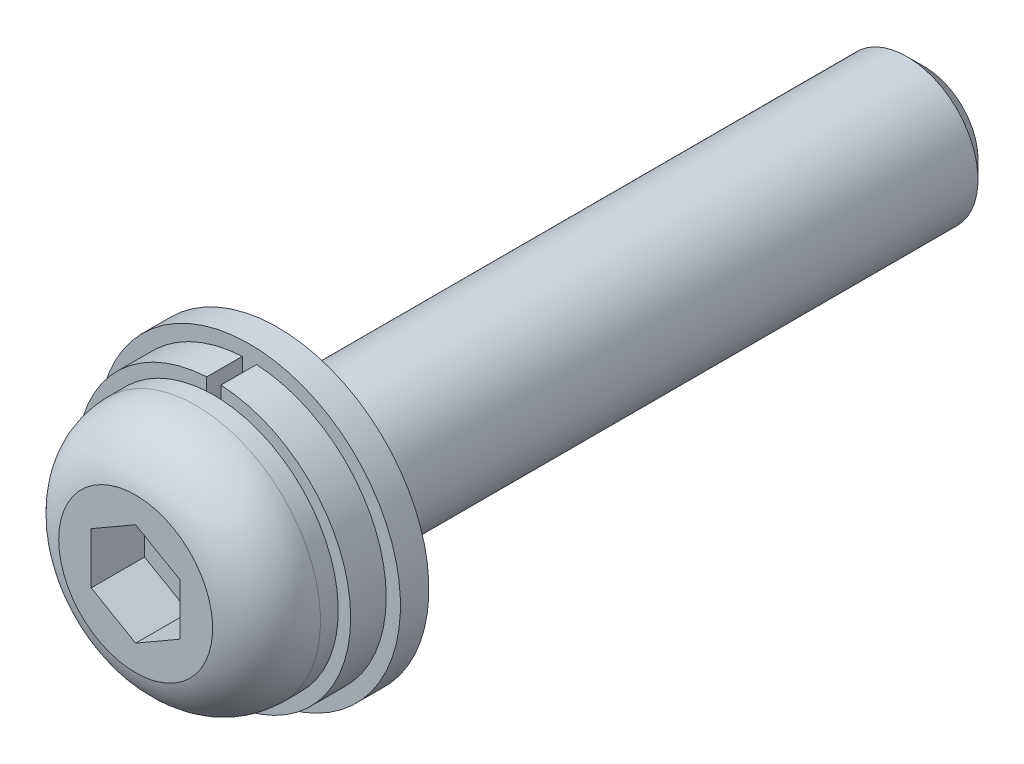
ISO-10303-21;
HEADER;
FILE_DESCRIPTION(('STEP AP214'),'2;1');
FILE_NAME('part.step','',(''),(''),'','','');
FILE_SCHEMA(('AUTOMOTIVE_DESIGN { 1 0 10303 214 1 1 1 1 }'));
ENDSEC;
DATA;
#1=APPLICATION_CONTEXT('core data for automotive mechanical design processes');
#2=APPLICATION_PROTOCOL_DEFINITION('international standard','automotive_design',2000,#1);
#3=PRODUCT_CONTEXT('',#1,'mechanical');
#4=PRODUCT('Part','Part','',(#3));
#5=PRODUCT_RELATED_PRODUCT_CATEGORY('part','',(#4));
#6=PRODUCT_DEFINITION_FORMATION('','',#4);
#7=PRODUCT_DEFINITION_CONTEXT('part definition',#1,'design');
#8=PRODUCT_DEFINITION('design','',#6,#7);
#9=PRODUCT_DEFINITION_SHAPE('','',#8);
#10=(LENGTH_UNIT() NAMED_UNIT(*) SI_UNIT(.MILLI.,.METRE.));
#11=(NAMED_UNIT(*) PLANE_ANGLE_UNIT() SI_UNIT($,.RADIAN.));
#12=(NAMED_UNIT(*) SI_UNIT($,.STERADIAN.) SOLID_ANGLE_UNIT());
#13=UNCERTAINTY_MEASURE_WITH_UNIT(LENGTH_MEASURE(1.E-05),#10,'distance_accuracy_value','');
#14=(GEOMETRIC_REPRESENTATION_CONTEXT(3) GLOBAL_UNCERTAINTY_ASSIGNED_CONTEXT((#13)) GLOBAL_UNIT_ASSIGNED_CONTEXT((#10,
#11,#12)) REPRESENTATION_CONTEXT('',''));
#15=CARTESIAN_POINT('',(0.,0.,0.));
#16=DIRECTION('',(0.,0.,1.));
#17=DIRECTION('',(1.,0.,0.));
#18=AXIS2_PLACEMENT_3D('',#15,#16,#17);
#19=CARTESIAN_POINT('',(0.,0.,1.6));
#20=DIRECTION('',(0.,0.,1.));
#21=DIRECTION('',(-1.,0.,0.));
#22=AXIS2_PLACEMENT_3D('',#19,#20,#21);
#23=PLANE('',#22);
#24=DIRECTION('',(0.,1.,0.));
#25=VECTOR('',#24,1.);
#26=CARTESIAN_POINT('',(-0.4,4.08044115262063,1.6));
#27=LINE('',#26,#25);
#28=CARTESIAN_POINT('',(-0.4,4.18090899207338,1.6));
#29=VERTEX_POINT('',#28);
#30=CARTESIAN_POINT('',(-0.4,7.68960337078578,1.6));
#31=VERTEX_POINT('',#30);
#32=EDGE_CURVE('E9',#29,#31,#27,.T.);
#33=ORIENTED_EDGE('',*,*,#32,.F.);
#34=CARTESIAN_POINT('',(0.,0.,1.6));
#35=DIRECTION('',(0.,0.,1.));
#36=DIRECTION('',(-1.,0.,0.));
#37=AXIS2_PLACEMENT_3D('',#34,#35,#36);
#38=CIRCLE('',#37,4.2);
#39=CARTESIAN_POINT('',(0.4,4.18090899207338,1.6));
#40=VERTEX_POINT('',#39);
#41=EDGE_CURVE('E199',#40,#29,#38,.T.);
#42=ORIENTED_EDGE('',*,*,#41,.F.);
#43=DIRECTION('',(0.,-1.,0.));
#44=VECTOR('',#43,1.);
#45=CARTESIAN_POINT('',(0.4,4.08044115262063,1.6));
#46=LINE('',#45,#44);
#47=CARTESIAN_POINT('',(0.4,7.68960337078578,1.6));
#48=VERTEX_POINT('',#47);
#49=EDGE_CURVE('E182',#48,#40,#46,.T.);
#50=ORIENTED_EDGE('',*,*,#49,.F.);
#51=CARTESIAN_POINT('',(0.,0.,1.6));
#52=DIRECTION('',(0.,0.,1.));
#53=DIRECTION('',(1.,0.,0.));
#54=AXIS2_PLACEMENT_3D('',#51,#52,#53);
#55=CIRCLE('',#54,7.7);
#56=EDGE_CURVE('E24',#31,#48,#55,.T.);
#57=ORIENTED_EDGE('',*,*,#56,.F.);
#58=EDGE_LOOP('',(#33,#42,#50,#57));
#59=FACE_BOUND('',#58,.T.);
#60=CARTESIAN_POINT('',(0.,0.,1.6));
#61=DIRECTION('',(0.,0.,1.));
#62=DIRECTION('',(-1.,0.,0.));
#63=AXIS2_PLACEMENT_3D('',#60,#61,#62);
#64=CIRCLE('',#63,8.5);
#65=CARTESIAN_POINT('',(-8.5,0.,1.6));
#66=VERTEX_POINT('',#65);
#67=EDGE_CURVE('E190',#66,#66,#64,.T.);
#68=ORIENTED_EDGE('',*,*,#67,.T.);
#69=EDGE_LOOP('',(#68));
#70=FACE_BOUND('',#69,.T.);
#71=ADVANCED_FACE('F14',(#59,#70),#23,.T.);
#72=CARTESIAN_POINT('',(0.,0.,0.));
#73=DIRECTION('',(0.,0.,1.));
#74=DIRECTION('',(-1.,0.,0.));
#75=AXIS2_PLACEMENT_3D('',#72,#73,#74);
#76=PLANE('',#75);
#77=CARTESIAN_POINT('',(0.,0.,0.));
#78=DIRECTION('',(0.,0.,1.));
#79=DIRECTION('',(-1.,0.,0.));
#80=AXIS2_PLACEMENT_3D('',#77,#78,#79);
#81=CIRCLE('',#80,8.5);
#82=CARTESIAN_POINT('',(-8.5,0.,0.));
#83=VERTEX_POINT('',#82);
#84=EDGE_CURVE('E194',#83,#83,#81,.T.);
#85=ORIENTED_EDGE('',*,*,#84,.F.);
#86=EDGE_LOOP('',(#85));
#87=FACE_BOUND('',#86,.T.);
#88=CARTESIAN_POINT('',(0.,0.,0.));
#89=DIRECTION('',(0.,0.,1.));
#90=DIRECTION('',(-1.,0.,0.));
#91=AXIS2_PLACEMENT_3D('',#88,#89,#90);
#92=CIRCLE('',#91,4.2);
#93=CARTESIAN_POINT('',(-4.2,0.,0.));
#94=VERTEX_POINT('',#93);
#95=EDGE_CURVE('E202',#94,#94,#92,.T.);
#96=ORIENTED_EDGE('',*,*,#95,.T.);
#97=EDGE_LOOP('',(#96));
#98=FACE_BOUND('',#97,.T.);
#99=ADVANCED_FACE('F257',(#87,#98),#76,.F.);
#100=CARTESIAN_POINT('',(0.,0.,1.6));
#101=DIRECTION('',(0.,0.,-1.));
#102=DIRECTION('',(1.,0.,0.));
#103=AXIS2_PLACEMENT_3D('',#100,#101,#102);
#104=CYLINDRICAL_SURFACE('',#103,8.5);
#105=ORIENTED_EDGE('',*,*,#67,.F.);
#106=EDGE_LOOP('',(#105));
#107=FACE_BOUND('',#106,.T.);
#108=ORIENTED_EDGE('',*,*,#84,.T.);
#109=EDGE_LOOP('',(#108));
#110=FACE_BOUND('',#109,.T.);
#111=ADVANCED_FACE('F260',(#107,#110),#104,.T.);
#112=CARTESIAN_POINT('',(0.,0.,1.6));
#113=DIRECTION('',(0.,0.,-1.));
#114=DIRECTION('',(1.,0.,0.));
#115=AXIS2_PLACEMENT_3D('',#112,#113,#114);
#116=CYLINDRICAL_SURFACE('',#115,4.2);
#117=ORIENTED_EDGE('',*,*,#41,.T.);
#118=EDGE_CURVE('E253',#29,#40,#38,.T.);
#119=ORIENTED_EDGE('',*,*,#118,.T.);
#120=EDGE_LOOP('',(#117,#119));
#121=FACE_BOUND('',#120,.T.);
#122=ORIENTED_EDGE('',*,*,#95,.F.);
#123=EDGE_LOOP('',(#122));
#124=FACE_BOUND('',#123,.T.);
#125=ADVANCED_FACE('F251',(#121,#124),#116,.F.);
#126=CARTESIAN_POINT('',(0.,-2.88675134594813,5.));
#127=DIRECTION('',(0.,0.,1.));
#128=DIRECTION('',(-1.,0.,0.));
#129=AXIS2_PLACEMENT_3D('',#126,#127,#128);
#130=PLANE('',#129);
#131=DIRECTION('',(0.866025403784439,-0.5,0.));
#132=VECTOR('',#131,1.);
#133=CARTESIAN_POINT('',(-2.5,-1.44337567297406,5.));
#134=LINE('',#133,#132);
#135=CARTESIAN_POINT('',(-2.5,-1.44337567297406,5.));
#136=VERTEX_POINT('',#135);
#137=CARTESIAN_POINT('',(0.,-2.88675134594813,5.));
#138=VERTEX_POINT('',#137);
#139=EDGE_CURVE('E139',#136,#138,#134,.T.);
#140=ORIENTED_EDGE('',*,*,#139,.T.);
#141=DIRECTION('',(0.866025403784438,0.5,0.));
#142=VECTOR('',#141,1.);
#143=CARTESIAN_POINT('',(0.,-2.88675134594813,5.));
#144=LINE('',#143,#142);
#145=CARTESIAN_POINT('',(2.5,-1.44337567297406,5.));
#146=VERTEX_POINT('',#145);
#147=EDGE_CURVE('E117',#138,#146,#144,.T.);
#148=ORIENTED_EDGE('',*,*,#147,.T.);
#149=DIRECTION('',(0.,1.,0.));
#150=VECTOR('',#149,1.);
#151=CARTESIAN_POINT('',(2.5,-1.44337567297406,5.));
#152=LINE('',#151,#150);
#153=CARTESIAN_POINT('',(2.5,1.44337567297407,5.));
#154=VERTEX_POINT('',#153);
#155=EDGE_CURVE('E142',#146,#154,#152,.T.);
#156=ORIENTED_EDGE('',*,*,#155,.T.);
#157=DIRECTION('',(-0.866025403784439,0.5,0.));
#158=VECTOR('',#157,1.);
#159=CARTESIAN_POINT('',(2.5,1.44337567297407,5.));
#160=LINE('',#159,#158);
#161=CARTESIAN_POINT('',(0.,2.88675134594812,5.));
#162=VERTEX_POINT('',#161);
#163=EDGE_CURVE('E145',#154,#162,#160,.T.);
#164=ORIENTED_EDGE('',*,*,#163,.T.);
#165=DIRECTION('',(-0.866025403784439,-0.5,0.));
#166=VECTOR('',#165,1.);
#167=CARTESIAN_POINT('',(0.,2.88675134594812,5.));
#168=LINE('',#167,#166);
#169=CARTESIAN_POINT('',(-2.5,1.44337567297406,5.));
#170=VERTEX_POINT('',#169);
#171=EDGE_CURVE('E148',#162,#170,#168,.T.);
#172=ORIENTED_EDGE('',*,*,#171,.T.);
#173=DIRECTION('',(0.,-1.,0.));
#174=VECTOR('',#173,1.);
#175=CARTESIAN_POINT('',(-2.5,1.44337567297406,5.));
#176=LINE('',#175,#174);
#177=EDGE_CURVE('E120',#170,#136,#176,.T.);
#178=ORIENTED_EDGE('',*,*,#177,.T.);
#179=EDGE_LOOP('',(#140,#148,#156,#164,#172,#178));
#180=FACE_BOUND('',#179,.T.);
#181=ADVANCED_FACE('F259',(#180),#130,.T.);
#182=CARTESIAN_POINT('',(2.5,-1.44337567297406,5.));
#183=DIRECTION('',(1.,0.,0.));
#184=DIRECTION('',(0.,1.,0.));
#185=AXIS2_PLACEMENT_3D('',#182,#183,#184);
#186=PLANE('',#185);
#187=DIRECTION('',(0.,1.,0.));
#188=VECTOR('',#187,1.);
#189=CARTESIAN_POINT('',(2.5,-1.44337567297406,8.));
#190=LINE('',#189,#188);
#191=CARTESIAN_POINT('',(2.5,-1.44337567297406,8.));
#192=VERTEX_POINT('',#191);
#193=CARTESIAN_POINT('',(2.5,1.44337567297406,8.));
#194=VERTEX_POINT('',#193);
#195=EDGE_CURVE('E126',#192,#194,#190,.T.);
#196=ORIENTED_EDGE('',*,*,#195,.T.);
#197=DIRECTION('',(0.,0.,1.));
#198=VECTOR('',#197,1.);
#199=CARTESIAN_POINT('',(2.5,1.44337567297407,5.));
#200=LINE('',#199,#198);
#201=EDGE_CURVE('E159',#154,#194,#200,.T.);
#202=ORIENTED_EDGE('',*,*,#201,.F.);
#203=ORIENTED_EDGE('',*,*,#155,.F.);
#204=DIRECTION('',(0.,0.,1.));
#205=VECTOR('',#204,1.);
#206=CARTESIAN_POINT('',(2.5,-1.44337567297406,5.));
#207=LINE('',#206,#205);
#208=EDGE_CURVE('E119',#146,#192,#207,.T.);
#209=ORIENTED_EDGE('',*,*,#208,.T.);
#210=EDGE_LOOP('',(#196,#202,#203,#209));
#211=FACE_BOUND('',#210,.T.);
#212=ADVANCED_FACE('F268',(#211),#186,.F.);
#213=CARTESIAN_POINT('',(2.5,1.44337567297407,5.));
#214=DIRECTION('',(0.5,0.866025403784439,0.));
#215=DIRECTION('',(-0.866025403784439,0.5,0.));
#216=AXIS2_PLACEMENT_3D('',#213,#214,#215);
#217=PLANE('',#216);
#218=DIRECTION('',(-0.866025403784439,0.5,0.));
#219=VECTOR('',#218,1.);
#220=CARTESIAN_POINT('',(2.5,1.44337567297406,8.));
#221=LINE('',#220,#219);
#222=CARTESIAN_POINT('',(0.,2.88675134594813,8.));
#223=VERTEX_POINT('',#222);
#224=EDGE_CURVE('E128',#194,#223,#221,.T.);
#225=ORIENTED_EDGE('',*,*,#224,.T.);
#226=DIRECTION('',(0.,0.,1.));
#227=VECTOR('',#226,1.);
#228=CARTESIAN_POINT('',(0.,2.88675134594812,5.));
#229=LINE('',#228,#227);
#230=EDGE_CURVE('E157',#162,#223,#229,.T.);
#231=ORIENTED_EDGE('',*,*,#230,.F.);
#232=ORIENTED_EDGE('',*,*,#163,.F.);
#233=ORIENTED_EDGE('',*,*,#201,.T.);
#234=EDGE_LOOP('',(#225,#231,#232,#233));
#235=FACE_BOUND('',#234,.T.);
#236=ADVANCED_FACE('F301',(#235),#217,.F.);
#237=CARTESIAN_POINT('',(0.,2.88675134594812,5.));
#238=DIRECTION('',(-0.5,0.866025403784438,0.));
#239=DIRECTION('',(-0.866025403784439,-0.5,0.));
#240=AXIS2_PLACEMENT_3D('',#237,#238,#239);
#241=PLANE('',#240);
#242=DIRECTION('',(-0.866025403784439,-0.5,0.));
#243=VECTOR('',#242,1.);
#244=CARTESIAN_POINT('',(0.,2.88675134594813,8.));
#245=LINE('',#244,#243);
#246=CARTESIAN_POINT('',(-2.5,1.44337567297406,8.));
#247=VERTEX_POINT('',#246);
#248=EDGE_CURVE('E134',#223,#247,#245,.T.);
#249=ORIENTED_EDGE('',*,*,#248,.T.);
#250=DIRECTION('',(0.,0.,1.));
#251=VECTOR('',#250,1.);
#252=CARTESIAN_POINT('',(-2.5,1.44337567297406,5.));
#253=LINE('',#252,#251);
#254=EDGE_CURVE('E155',#170,#247,#253,.T.);
#255=ORIENTED_EDGE('',*,*,#254,.F.);
#256=ORIENTED_EDGE('',*,*,#171,.F.);
#257=ORIENTED_EDGE('',*,*,#230,.T.);
#258=EDGE_LOOP('',(#249,#255,#256,#257));
#259=FACE_BOUND('',#258,.T.);
#260=ADVANCED_FACE('F298',(#259),#241,.F.);
#261=CARTESIAN_POINT('',(-2.5,1.44337567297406,5.));
#262=DIRECTION('',(-1.,0.,0.));
#263=DIRECTION('',(0.,-1.,0.));
#264=AXIS2_PLACEMENT_3D('',#261,#262,#263);
#265=PLANE('',#264);
#266=DIRECTION('',(0.,-1.,0.));
#267=VECTOR('',#266,1.);
#268=CARTESIAN_POINT('',(-2.5,1.44337567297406,8.));
#269=LINE('',#268,#267);
#270=CARTESIAN_POINT('',(-2.5,-1.44337567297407,8.));
#271=VERTEX_POINT('',#270);
#272=EDGE_CURVE('E137',#247,#271,#269,.T.);
#273=ORIENTED_EDGE('',*,*,#272,.T.);
#274=DIRECTION('',(0.,0.,1.));
#275=VECTOR('',#274,1.);
#276=CARTESIAN_POINT('',(-2.5,-1.44337567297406,5.));
#277=LINE('',#276,#275);
#278=EDGE_CURVE('E97',#136,#271,#277,.T.);
#279=ORIENTED_EDGE('',*,*,#278,.F.);
#280=ORIENTED_EDGE('',*,*,#177,.F.);
#281=ORIENTED_EDGE('',*,*,#254,.T.);
#282=EDGE_LOOP('',(#273,#279,#280,#281));
#283=FACE_BOUND('',#282,.T.);
#284=ADVANCED_FACE('F295',(#283),#265,.F.);
#285=CARTESIAN_POINT('',(-2.5,-1.44337567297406,5.));
#286=DIRECTION('',(-0.5,-0.866025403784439,0.));
#287=DIRECTION('',(0.866025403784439,-0.5,0.));
#288=AXIS2_PLACEMENT_3D('',#285,#286,#287);
#289=PLANE('',#288);
#290=DIRECTION('',(0.866025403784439,-0.5,0.));
#291=VECTOR('',#290,1.);
#292=CARTESIAN_POINT('',(-2.5,-1.44337567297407,8.));
#293=LINE('',#292,#291);
#294=CARTESIAN_POINT('',(0.,-2.88675134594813,8.));
#295=VERTEX_POINT('',#294);
#296=EDGE_CURVE('E102',#271,#295,#293,.T.);
#297=ORIENTED_EDGE('',*,*,#296,.T.);
#298=DIRECTION('',(0.,0.,1.));
#299=VECTOR('',#298,1.);
#300=CARTESIAN_POINT('',(0.,-2.88675134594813,5.));
#301=LINE('',#300,#299);
#302=EDGE_CURVE('E105',#138,#295,#301,.T.);
#303=ORIENTED_EDGE('',*,*,#302,.F.);
#304=ORIENTED_EDGE('',*,*,#139,.F.);
#305=ORIENTED_EDGE('',*,*,#278,.T.);
#306=EDGE_LOOP('',(#297,#303,#304,#305));
#307=FACE_BOUND('',#306,.T.);
#308=ADVANCED_FACE('F104',(#307),#289,.F.);
#309=CARTESIAN_POINT('',(0.,-2.88675134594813,5.));
#310=DIRECTION('',(0.5,-0.866025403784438,0.));
#311=DIRECTION('',(0.866025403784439,0.5,0.));
#312=AXIS2_PLACEMENT_3D('',#309,#310,#311);
#313=PLANE('',#312);
#314=DIRECTION('',(0.866025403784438,0.5,0.));
#315=VECTOR('',#314,1.);
#316=CARTESIAN_POINT('',(0.,-2.88675134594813,8.));
#317=LINE('',#316,#315);
#318=EDGE_CURVE('E110',#295,#192,#317,.T.);
#319=ORIENTED_EDGE('',*,*,#318,.T.);
#320=ORIENTED_EDGE('',*,*,#208,.F.);
#321=ORIENTED_EDGE('',*,*,#147,.F.);
#322=ORIENTED_EDGE('',*,*,#302,.T.);
#323=EDGE_LOOP('',(#319,#320,#321,#322));
#324=FACE_BOUND('',#323,.T.);
#325=ADVANCED_FACE('F114',(#324),#313,.F.);
#326=CARTESIAN_POINT('',(0.,0.,8.));
#327=DIRECTION('',(0.,0.,-1.));
#328=DIRECTION('',(1.,0.,0.));
#329=AXIS2_PLACEMENT_3D('',#326,#327,#328);
#330=PLANE('',#329);
#331=ORIENTED_EDGE('',*,*,#318,.F.);
#332=ORIENTED_EDGE('',*,*,#296,.F.);
#333=ORIENTED_EDGE('',*,*,#272,.F.);
#334=ORIENTED_EDGE('',*,*,#248,.F.);
#335=ORIENTED_EDGE('',*,*,#224,.F.);
#336=ORIENTED_EDGE('',*,*,#195,.F.);
#337=EDGE_LOOP('',(#331,#332,#333,#334,#335,#336));
#338=FACE_BOUND('',#337,.T.);
#339=CARTESIAN_POINT('',(0.,0.,8.));
#340=DIRECTION('',(0.,0.,1.));
#341=DIRECTION('',(-1.,0.,0.));
#342=AXIS2_PLACEMENT_3D('',#339,#340,#341);
#343=CIRCLE('',#342,4.3306623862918);
#344=CARTESIAN_POINT('',(-4.3306623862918,0.,8.));
#345=VERTEX_POINT('',#344);
#346=EDGE_CURVE('E164',#345,#345,#343,.T.);
#347=ORIENTED_EDGE('',*,*,#346,.T.);
#348=EDGE_LOOP('',(#347));
#349=FACE_BOUND('',#348,.T.);
#350=ADVANCED_FACE('F122',(#338,#349),#330,.F.);
#351=CARTESIAN_POINT('',(4.,0.,-36.4));
#352=DIRECTION('',(0.,0.,1.));
#353=DIRECTION('',(-1.,0.,0.));
#354=AXIS2_PLACEMENT_3D('',#351,#352,#353);
#355=PLANE('',#354);
#356=CARTESIAN_POINT('',(0.,0.,-36.4));
#357=DIRECTION('',(0.,0.,1.));
#358=DIRECTION('',(-1.,0.,0.));
#359=AXIS2_PLACEMENT_3D('',#356,#357,#358);
#360=CIRCLE('',#359,3.);
#361=CARTESIAN_POINT('',(-3.,0.,-36.4));
#362=VERTEX_POINT('',#361);
#363=EDGE_CURVE('E18',#362,#362,#360,.F.);
#364=ORIENTED_EDGE('',*,*,#363,.T.);
#365=EDGE_LOOP('',(#364));
#366=FACE_BOUND('',#365,.T.);
#367=ADVANCED_FACE('F320',(#366),#355,.F.);
#368=CARTESIAN_POINT('',(0.,0.,4.6));
#369=DIRECTION('',(0.,0.,1.));
#370=DIRECTION('',(-1.,0.,0.));
#371=AXIS2_PLACEMENT_3D('',#368,#369,#370);
#372=DEGENERATE_TOROIDAL_SURFACE('',#371,3.5,3.5,.T.);
#373=ORIENTED_EDGE('',*,*,#346,.F.);
#374=EDGE_LOOP('',(#373));
#375=FACE_BOUND('',#374,.T.);
#376=CARTESIAN_POINT('',(0.,0.,4.6));
#377=DIRECTION('',(0.,0.,1.));
#378=DIRECTION('',(-1.,0.,0.));
#379=AXIS2_PLACEMENT_3D('',#376,#377,#378);
#380=CIRCLE('',#379,7.);
#381=CARTESIAN_POINT('',(-7.,0.,4.6));
#382=VERTEX_POINT('',#381);
#383=EDGE_CURVE('E167',#382,#382,#380,.T.);
#384=ORIENTED_EDGE('',*,*,#383,.T.);
#385=EDGE_LOOP('',(#384));
#386=FACE_BOUND('',#385,.T.);
#387=ADVANCED_FACE('F316',(#375,#386),#372,.T.);
#388=CARTESIAN_POINT('',(0.,0.,-35.4));
#389=DIRECTION('',(0.,0.,1.));
#390=DIRECTION('',(-1.,0.,0.));
#391=AXIS2_PLACEMENT_3D('',#388,#389,#390);
#392=CONICAL_SURFACE('',#391,4.,0.785398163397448);
#393=ORIENTED_EDGE('',*,*,#363,.F.);
#394=EDGE_LOOP('',(#393));
#395=FACE_BOUND('',#394,.T.);
#396=CARTESIAN_POINT('',(0.,0.,-35.4));
#397=DIRECTION('',(0.,0.,1.));
#398=DIRECTION('',(-1.,0.,0.));
#399=AXIS2_PLACEMENT_3D('',#396,#397,#398);
#400=CIRCLE('',#399,4.);
#401=CARTESIAN_POINT('',(-4.,0.,-35.4));
#402=VERTEX_POINT('',#401);
#403=EDGE_CURVE('E172',#402,#402,#400,.T.);
#404=ORIENTED_EDGE('',*,*,#403,.F.);
#405=EDGE_LOOP('',(#404));
#406=FACE_BOUND('',#405,.T.);
#407=ADVANCED_FACE('F313',(#395,#406),#392,.T.);
#408=CARTESIAN_POINT('',(0.,0.,8.));
#409=DIRECTION('',(0.,0.,1.));
#410=DIRECTION('',(-1.,0.,0.));
#411=AXIS2_PLACEMENT_3D('',#408,#409,#410);
#412=CYLINDRICAL_SURFACE('',#411,7.);
#413=ORIENTED_EDGE('',*,*,#383,.F.);
#414=EDGE_LOOP('',(#413));
#415=FACE_BOUND('',#414,.T.);
#416=CARTESIAN_POINT('',(0.,0.,3.6));
#417=DIRECTION('',(0.,0.,1.));
#418=DIRECTION('',(-1.,0.,0.));
#419=AXIS2_PLACEMENT_3D('',#416,#417,#418);
#420=CIRCLE('',#419,7.);
#421=CARTESIAN_POINT('',(0.4,6.98856208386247,3.6));
#422=VERTEX_POINT('',#421);
#423=CARTESIAN_POINT('',(-0.4,6.98856208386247,3.6));
#424=VERTEX_POINT('',#423);
#425=EDGE_CURVE('E170',#422,#424,#420,.T.);
#426=ORIENTED_EDGE('',*,*,#425,.T.);
#427=CARTESIAN_POINT('',(0.,0.,3.6));
#428=DIRECTION('',(0.,0.,1.));
#429=DIRECTION('',(0.,-1.,0.));
#430=AXIS2_PLACEMENT_3D('',#427,#428,#429);
#431=CIRCLE('',#430,7.);
#432=EDGE_CURVE('E231',#422,#424,#431,.F.);
#433=ORIENTED_EDGE('',*,*,#432,.F.);
#434=EDGE_LOOP('',(#426,#433));
#435=FACE_BOUND('',#434,.T.);
#436=ADVANCED_FACE('F287',(#415,#435),#412,.T.);
#437=CARTESIAN_POINT('',(0.,0.,8.));
#438=DIRECTION('',(0.,0.,1.));
#439=DIRECTION('',(-1.,0.,0.));
#440=AXIS2_PLACEMENT_3D('',#437,#438,#439);
#441=CYLINDRICAL_SURFACE('',#440,4.);
#442=ORIENTED_EDGE('',*,*,#403,.T.);
#443=EDGE_LOOP('',(#442));
#444=FACE_BOUND('',#443,.T.);
#445=CARTESIAN_POINT('',(0.,0.,3.6));
#446=DIRECTION('',(0.,0.,1.));
#447=DIRECTION('',(-1.,0.,0.));
#448=AXIS2_PLACEMENT_3D('',#445,#446,#447);
#449=CIRCLE('',#448,4.);
#450=CARTESIAN_POINT('',(-4.,0.,3.6));
#451=VERTEX_POINT('',#450);
#452=EDGE_CURVE('E154',#451,#451,#449,.T.);
#453=ORIENTED_EDGE('',*,*,#452,.F.);
#454=EDGE_LOOP('',(#453));
#455=FACE_BOUND('',#454,.T.);
#456=ADVANCED_FACE('F293',(#444,#455),#441,.T.);
#457=CARTESIAN_POINT('',(0.,0.,3.6));
#458=DIRECTION('',(0.,0.,-1.));
#459=DIRECTION('',(-1.,0.,0.));
#460=AXIS2_PLACEMENT_3D('',#457,#458,#459);
#461=CYLINDRICAL_SURFACE('',#460,7.7);
#462=ORIENTED_EDGE('',*,*,#56,.T.);
#463=DIRECTION('',(0.,0.,-1.));
#464=VECTOR('',#463,1.);
#465=CARTESIAN_POINT('',(0.4,7.68960337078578,3.6));
#466=LINE('',#465,#464);
#467=CARTESIAN_POINT('',(0.4,7.68960337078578,3.6));
#468=VERTEX_POINT('',#467);
#469=EDGE_CURVE('E237',#468,#48,#466,.T.);
#470=ORIENTED_EDGE('',*,*,#469,.F.);
#471=CARTESIAN_POINT('',(0.,0.,3.6));
#472=DIRECTION('',(0.,0.,1.));
#473=DIRECTION('',(1.,0.,0.));
#474=AXIS2_PLACEMENT_3D('',#471,#472,#473);
#475=CIRCLE('',#474,7.7);
#476=CARTESIAN_POINT('',(-0.4,7.68960337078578,3.6));
#477=VERTEX_POINT('',#476);
#478=EDGE_CURVE('E205',#477,#468,#475,.T.);
#479=ORIENTED_EDGE('',*,*,#478,.F.);
#480=DIRECTION('',(0.,0.,-1.));
#481=VECTOR('',#480,1.);
#482=CARTESIAN_POINT('',(-0.4,7.68960337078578,3.6));
#483=LINE('',#482,#481);
#484=EDGE_CURVE('E217',#477,#31,#483,.T.);
#485=ORIENTED_EDGE('',*,*,#484,.T.);
#486=EDGE_LOOP('',(#462,#470,#479,#485));
#487=FACE_BOUND('',#486,.T.);
#488=ADVANCED_FACE('F236',(#487),#461,.T.);
#489=CARTESIAN_POINT('',(0.,0.,3.6));
#490=DIRECTION('',(0.,0.,1.));
#491=DIRECTION('',(1.,0.,0.));
#492=AXIS2_PLACEMENT_3D('',#489,#490,#491);
#493=PLANE('',#492);
#494=DIRECTION('',(0.,-1.,0.));
#495=VECTOR('',#494,1.);
#496=CARTESIAN_POINT('',(0.4,4.08044115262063,3.6));
#497=LINE('',#496,#495);
#498=EDGE_CURVE('E209',#468,#422,#497,.T.);
#499=ORIENTED_EDGE('',*,*,#498,.T.);
#500=ORIENTED_EDGE('',*,*,#432,.T.);
#501=DIRECTION('',(0.,1.,0.));
#502=VECTOR('',#501,1.);
#503=CARTESIAN_POINT('',(-0.4,4.08044115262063,3.6));
#504=LINE('',#503,#502);
#505=EDGE_CURVE('E215',#424,#477,#504,.T.);
#506=ORIENTED_EDGE('',*,*,#505,.T.);
#507=ORIENTED_EDGE('',*,*,#478,.T.);
#508=EDGE_LOOP('',(#499,#500,#506,#507));
#509=FACE_BOUND('',#508,.T.);
#510=ADVANCED_FACE('F227',(#509),#493,.T.);
#511=CARTESIAN_POINT('',(4.,0.,3.6));
#512=DIRECTION('',(0.,0.,1.));
#513=DIRECTION('',(-1.,0.,0.));
#514=AXIS2_PLACEMENT_3D('',#511,#512,#513);
#515=PLANE('',#514);
#516=ORIENTED_EDGE('',*,*,#452,.T.);
#517=EDGE_LOOP('',(#516));
#518=FACE_BOUND('',#517,.T.);
#519=ORIENTED_EDGE('',*,*,#425,.F.);
#520=CARTESIAN_POINT('',(0.4,4.08044115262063,3.6));
#521=VERTEX_POINT('',#520);
#522=EDGE_CURVE('E208',#422,#521,#497,.T.);
#523=ORIENTED_EDGE('',*,*,#522,.T.);
#524=CARTESIAN_POINT('',(0.,0.,3.6));
#525=DIRECTION('',(0.,0.,-1.));
#526=DIRECTION('',(1.,0.,0.));
#527=AXIS2_PLACEMENT_3D('',#524,#525,#526);
#528=CIRCLE('',#527,4.1);
#529=CARTESIAN_POINT('',(-0.4,4.08044115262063,3.6));
#530=VERTEX_POINT('',#529);
#531=EDGE_CURVE('E212',#521,#530,#528,.T.);
#532=ORIENTED_EDGE('',*,*,#531,.T.);
#533=EDGE_CURVE('E216',#530,#424,#504,.T.);
#534=ORIENTED_EDGE('',*,*,#533,.T.);
#535=EDGE_LOOP('',(#519,#523,#532,#534));
#536=FACE_BOUND('',#535,.T.);
#537=ADVANCED_FACE('F16',(#518,#536),#515,.F.);
#538=CARTESIAN_POINT('',(0.,0.,3.6));
#539=DIRECTION('',(0.,0.,-1.));
#540=DIRECTION('',(-1.,0.,0.));
#541=AXIS2_PLACEMENT_3D('',#538,#539,#540);
#542=CYLINDRICAL_SURFACE('',#541,4.1);
#543=CARTESIAN_POINT('',(0.,0.,1.6));
#544=DIRECTION('',(0.,0.,-1.));
#545=DIRECTION('',(1.,0.,0.));
#546=AXIS2_PLACEMENT_3D('',#543,#544,#545);
#547=CIRCLE('',#546,4.1);
#548=CARTESIAN_POINT('',(0.4,4.08044115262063,1.6));
#549=VERTEX_POINT('',#548);
#550=CARTESIAN_POINT('',(-0.4,4.08044115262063,1.6));
#551=VERTEX_POINT('',#550);
#552=EDGE_CURVE('E180',#549,#551,#547,.T.);
#553=ORIENTED_EDGE('',*,*,#552,.T.);
#554=DIRECTION('',(0.,0.,-1.));
#555=VECTOR('',#554,1.);
#556=CARTESIAN_POINT('',(-0.4,4.08044115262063,3.6));
#557=LINE('',#556,#555);
#558=EDGE_CURVE('E222',#530,#551,#557,.T.);
#559=ORIENTED_EDGE('',*,*,#558,.F.);
#560=ORIENTED_EDGE('',*,*,#531,.F.);
#561=DIRECTION('',(0.,0.,-1.));
#562=VECTOR('',#561,1.);
#563=CARTESIAN_POINT('',(0.4,4.08044115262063,3.6));
#564=LINE('',#563,#562);
#565=EDGE_CURVE('E238',#521,#549,#564,.T.);
#566=ORIENTED_EDGE('',*,*,#565,.T.);
#567=EDGE_LOOP('',(#553,#559,#560,#566));
#568=FACE_BOUND('',#567,.T.);
#569=ADVANCED_FACE('F274',(#568),#542,.F.);
#570=CARTESIAN_POINT('',(0.,0.,1.6));
#571=DIRECTION('',(0.,0.,1.));
#572=DIRECTION('',(1.,0.,0.));
#573=AXIS2_PLACEMENT_3D('',#570,#571,#572);
#574=PLANE('',#573);
#575=ORIENTED_EDGE('',*,*,#118,.F.);
#576=EDGE_CURVE('E26',#551,#29,#27,.T.);
#577=ORIENTED_EDGE('',*,*,#576,.F.);
#578=ORIENTED_EDGE('',*,*,#552,.F.);
#579=EDGE_CURVE('E177',#40,#549,#46,.T.);
#580=ORIENTED_EDGE('',*,*,#579,.F.);
#581=EDGE_LOOP('',(#575,#577,#578,#580));
#582=FACE_BOUND('',#581,.T.);
#583=ADVANCED_FACE('F276',(#582),#574,.F.);
#584=CARTESIAN_POINT('',(0.4,4.08044115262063,3.6));
#585=DIRECTION('',(1.,0.,0.));
#586=DIRECTION('',(0.,1.,0.));
#587=AXIS2_PLACEMENT_3D('',#584,#585,#586);
#588=PLANE('',#587);
#589=ORIENTED_EDGE('',*,*,#49,.T.);
#590=ORIENTED_EDGE('',*,*,#579,.T.);
#591=ORIENTED_EDGE('',*,*,#565,.F.);
#592=ORIENTED_EDGE('',*,*,#522,.F.);
#593=ORIENTED_EDGE('',*,*,#498,.F.);
#594=ORIENTED_EDGE('',*,*,#469,.T.);
#595=EDGE_LOOP('',(#589,#590,#591,#592,#593,#594));
#596=FACE_BOUND('',#595,.T.);
#597=ADVANCED_FACE('F284',(#596),#588,.F.);
#598=CARTESIAN_POINT('',(-0.4,4.08044115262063,3.6));
#599=DIRECTION('',(-1.,0.,0.));
#600=DIRECTION('',(0.,-1.,0.));
#601=AXIS2_PLACEMENT_3D('',#598,#599,#600);
#602=PLANE('',#601);
#603=ORIENTED_EDGE('',*,*,#576,.T.);
#604=ORIENTED_EDGE('',*,*,#32,.T.);
#605=ORIENTED_EDGE('',*,*,#484,.F.);
#606=ORIENTED_EDGE('',*,*,#505,.F.);
#607=ORIENTED_EDGE('',*,*,#533,.F.);
#608=ORIENTED_EDGE('',*,*,#558,.T.);
#609=EDGE_LOOP('',(#603,#604,#605,#606,#607,#608));
#610=FACE_BOUND('',#609,.T.);
#611=ADVANCED_FACE('F234',(#610),#602,.F.);
#612=CLOSED_SHELL('',(#71,#99,#111,#125,#181,#212,#236,#260,#284,#308,#325,#350,#367,#387,#407,
#436,#456,#488,#510,#537,#569,#583,#597,#611));
#613=MANIFOLD_SOLID_BREP('B1',#612);
#614=ADVANCED_BREP_SHAPE_REPRESENTATION('',(#18,#613),#14);
#615=SHAPE_DEFINITION_REPRESENTATION(#9,#614);
ENDSEC;
END-ISO-10303-21;
